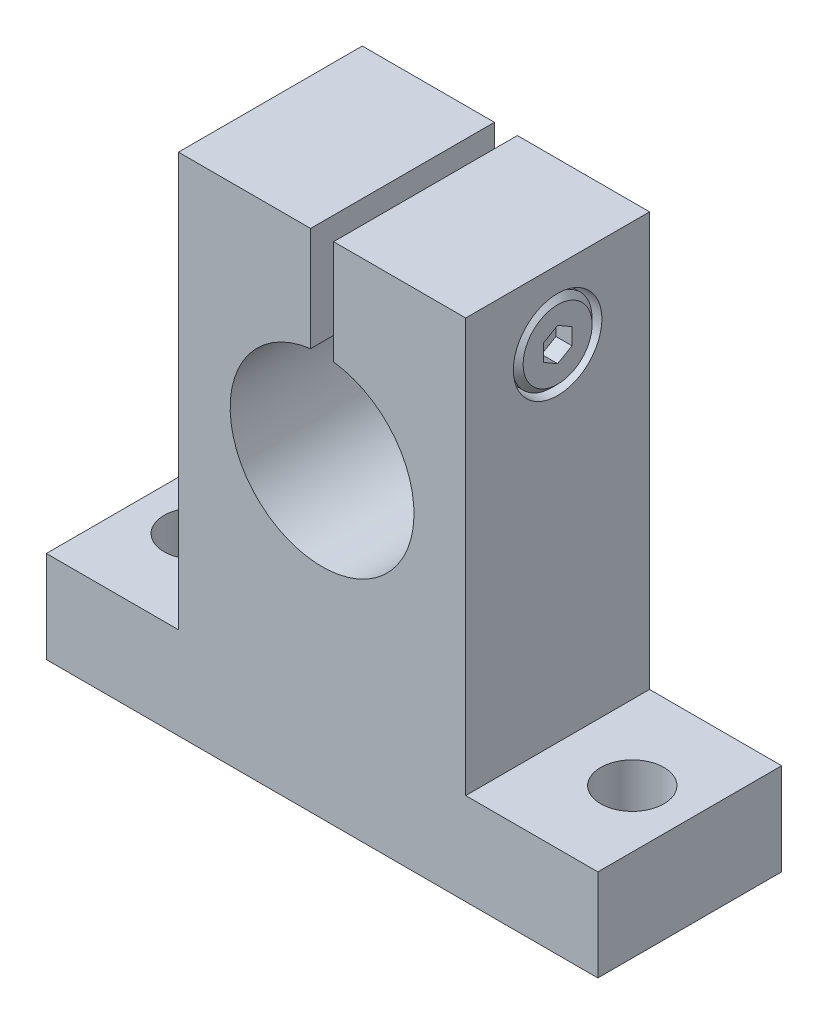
ISO-10303-21;
HEADER;
FILE_DESCRIPTION(('STEP AP214'),'2;1');
FILE_NAME('part.step','',(''),(''),'','','');
FILE_SCHEMA(('AUTOMOTIVE_DESIGN { 1 0 10303 214 1 1 1 1 }'));
ENDSEC;
DATA;
#1=APPLICATION_CONTEXT('core data for automotive mechanical design processes');
#2=APPLICATION_PROTOCOL_DEFINITION('international standard','automotive_design',2000,#1);
#3=PRODUCT_CONTEXT('',#1,'mechanical');
#4=PRODUCT('Part','Part','',(#3));
#5=PRODUCT_RELATED_PRODUCT_CATEGORY('part','',(#4));
#6=PRODUCT_DEFINITION_FORMATION('','',#4);
#7=PRODUCT_DEFINITION_CONTEXT('part definition',#1,'design');
#8=PRODUCT_DEFINITION('design','',#6,#7);
#9=PRODUCT_DEFINITION_SHAPE('','',#8);
#10=(LENGTH_UNIT() NAMED_UNIT(*) SI_UNIT(.MILLI.,.METRE.));
#11=(NAMED_UNIT(*) PLANE_ANGLE_UNIT() SI_UNIT($,.RADIAN.));
#12=(NAMED_UNIT(*) SI_UNIT($,.STERADIAN.) SOLID_ANGLE_UNIT());
#13=UNCERTAINTY_MEASURE_WITH_UNIT(LENGTH_MEASURE(1.E-05),#10,'distance_accuracy_value','');
#14=(GEOMETRIC_REPRESENTATION_CONTEXT(3) GLOBAL_UNCERTAINTY_ASSIGNED_CONTEXT((#13)) GLOBAL_UNIT_ASSIGNED_CONTEXT((#10,
#11,#12)) REPRESENTATION_CONTEXT('',''));
#15=CARTESIAN_POINT('',(0.,0.,0.));
#16=DIRECTION('',(0.,0.,1.));
#17=DIRECTION('',(1.,0.,0.));
#18=AXIS2_PLACEMENT_3D('',#15,#16,#17);
#19=CARTESIAN_POINT('',(0.,0.,-16.));
#20=DIRECTION('',(0.,0.,1.));
#21=DIRECTION('',(1.,0.,0.));
#22=AXIS2_PLACEMENT_3D('',#19,#20,#21);
#23=PLANE('',#22);
#24=DIRECTION('',(0.,1.,0.));
#25=VECTOR('',#24,1.);
#26=CARTESIAN_POINT('',(1.,0.,-16.));
#27=LINE('',#26,#25);
#28=CARTESIAN_POINT('',(1.,7.93725393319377,-16.));
#29=VERTEX_POINT('',#28);
#30=CARTESIAN_POINT('',(1.,17.,-16.));
#31=VERTEX_POINT('',#30);
#32=EDGE_CURVE('E222',#29,#31,#27,.T.);
#33=ORIENTED_EDGE('',*,*,#32,.T.);
#34=DIRECTION('',(-1.,0.,0.));
#35=VECTOR('',#34,1.);
#36=CARTESIAN_POINT('',(12.5,17.,-16.));
#37=LINE('',#36,#35);
#38=CARTESIAN_POINT('',(12.5,17.,-16.));
#39=VERTEX_POINT('',#38);
#40=EDGE_CURVE('E216',#39,#31,#37,.T.);
#41=ORIENTED_EDGE('',*,*,#40,.F.);
#42=DIRECTION('',(0.,1.,0.));
#43=VECTOR('',#42,1.);
#44=CARTESIAN_POINT('',(12.5,-19.,-16.));
#45=LINE('',#44,#43);
#46=CARTESIAN_POINT('',(12.5,-19.,-16.));
#47=VERTEX_POINT('',#46);
#48=EDGE_CURVE('E219',#47,#39,#45,.T.);
#49=ORIENTED_EDGE('',*,*,#48,.F.);
#50=DIRECTION('',(-1.,0.,0.));
#51=VECTOR('',#50,1.);
#52=CARTESIAN_POINT('',(24.,-19.,-16.));
#53=LINE('',#52,#51);
#54=CARTESIAN_POINT('',(24.,-19.,-16.));
#55=VERTEX_POINT('',#54);
#56=EDGE_CURVE('E247',#55,#47,#53,.T.);
#57=ORIENTED_EDGE('',*,*,#56,.F.);
#58=DIRECTION('',(0.,1.,0.));
#59=VECTOR('',#58,1.);
#60=CARTESIAN_POINT('',(24.,-27.,-16.));
#61=LINE('',#60,#59);
#62=CARTESIAN_POINT('',(24.,-27.,-16.));
#63=VERTEX_POINT('',#62);
#64=EDGE_CURVE('E388',#63,#55,#61,.T.);
#65=ORIENTED_EDGE('',*,*,#64,.F.);
#66=DIRECTION('',(1.,0.,0.));
#67=VECTOR('',#66,1.);
#68=CARTESIAN_POINT('',(-24.,-27.,-16.));
#69=LINE('',#68,#67);
#70=CARTESIAN_POINT('',(-24.,-27.,-16.));
#71=VERTEX_POINT('',#70);
#72=EDGE_CURVE('E10',#71,#63,#69,.T.);
#73=ORIENTED_EDGE('',*,*,#72,.F.);
#74=DIRECTION('',(0.,-1.,0.));
#75=VECTOR('',#74,1.);
#76=CARTESIAN_POINT('',(-24.,-19.,-16.));
#77=LINE('',#76,#75);
#78=CARTESIAN_POINT('',(-24.,-19.,-16.));
#79=VERTEX_POINT('',#78);
#80=EDGE_CURVE('E45',#79,#71,#77,.T.);
#81=ORIENTED_EDGE('',*,*,#80,.F.);
#82=DIRECTION('',(-1.,0.,0.));
#83=VECTOR('',#82,1.);
#84=CARTESIAN_POINT('',(-12.5,-19.,-16.));
#85=LINE('',#84,#83);
#86=CARTESIAN_POINT('',(-12.5,-19.,-16.));
#87=VERTEX_POINT('',#86);
#88=EDGE_CURVE('E254',#87,#79,#85,.T.);
#89=ORIENTED_EDGE('',*,*,#88,.F.);
#90=DIRECTION('',(0.,-1.,0.));
#91=VECTOR('',#90,1.);
#92=CARTESIAN_POINT('',(-12.5,17.,-16.));
#93=LINE('',#92,#91);
#94=CARTESIAN_POINT('',(-12.5,17.,-16.));
#95=VERTEX_POINT('',#94);
#96=EDGE_CURVE('E227',#95,#87,#93,.T.);
#97=ORIENTED_EDGE('',*,*,#96,.F.);
#98=DIRECTION('',(-1.,0.,0.));
#99=VECTOR('',#98,1.);
#100=CARTESIAN_POINT('',(12.5,17.,-16.));
#101=LINE('',#100,#99);
#102=CARTESIAN_POINT('',(-1.,17.,-16.));
#103=VERTEX_POINT('',#102);
#104=EDGE_CURVE('E276',#103,#95,#101,.T.);
#105=ORIENTED_EDGE('',*,*,#104,.F.);
#106=DIRECTION('',(0.,-1.,0.));
#107=VECTOR('',#106,1.);
#108=CARTESIAN_POINT('',(-1.,8.5,-16.));
#109=LINE('',#108,#107);
#110=CARTESIAN_POINT('',(-1.,7.93725393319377,-16.));
#111=VERTEX_POINT('',#110);
#112=EDGE_CURVE('E344',#103,#111,#109,.T.);
#113=ORIENTED_EDGE('',*,*,#112,.T.);
#114=CARTESIAN_POINT('',(0.,0.,-16.));
#115=DIRECTION('',(0.,0.,1.));
#116=DIRECTION('',(1.,0.,0.));
#117=AXIS2_PLACEMENT_3D('',#114,#115,#116);
#118=CIRCLE('',#117,8.);
#119=EDGE_CURVE('E429',#111,#29,#118,.T.);
#120=ORIENTED_EDGE('',*,*,#119,.T.);
#121=EDGE_LOOP('',(#33,#41,#49,#57,#65,#73,#81,#89,#97,#105,#113,#120));
#122=FACE_BOUND('',#121,.T.);
#123=ADVANCED_FACE('F16',(#122),#23,.F.);
#124=CARTESIAN_POINT('',(-24.,-27.,0.));
#125=DIRECTION('',(0.,-1.,0.));
#126=DIRECTION('',(0.,0.,-1.));
#127=AXIS2_PLACEMENT_3D('',#124,#125,#126);
#128=PLANE('',#127);
#129=CARTESIAN_POINT('',(19.,-27.,-8.));
#130=DIRECTION('',(0.,1.,0.));
#131=DIRECTION('',(0.,0.,-1.));
#132=AXIS2_PLACEMENT_3D('',#129,#130,#131);
#133=CIRCLE('',#132,2.75);
#134=CARTESIAN_POINT('',(19.,-27.,-5.25));
#135=VERTEX_POINT('',#134);
#136=EDGE_CURVE('E461',#135,#135,#133,.T.);
#137=ORIENTED_EDGE('',*,*,#136,.T.);
#138=EDGE_LOOP('',(#137));
#139=FACE_BOUND('',#138,.T.);
#140=CARTESIAN_POINT('',(-19.,-27.,-8.));
#141=DIRECTION('',(0.,1.,0.));
#142=DIRECTION('',(0.,0.,-1.));
#143=AXIS2_PLACEMENT_3D('',#140,#141,#142);
#144=CIRCLE('',#143,2.75);
#145=CARTESIAN_POINT('',(-19.,-27.,-5.25));
#146=VERTEX_POINT('',#145);
#147=EDGE_CURVE('E452',#146,#146,#144,.T.);
#148=ORIENTED_EDGE('',*,*,#147,.T.);
#149=EDGE_LOOP('',(#148));
#150=FACE_BOUND('',#149,.T.);
#151=ORIENTED_EDGE('',*,*,#72,.T.);
#152=DIRECTION('',(0.,0.,-1.));
#153=VECTOR('',#152,1.);
#154=CARTESIAN_POINT('',(24.,-27.,0.));
#155=LINE('',#154,#153);
#156=CARTESIAN_POINT('',(24.,-27.,0.));
#157=VERTEX_POINT('',#156);
#158=EDGE_CURVE('E336',#157,#63,#155,.T.);
#159=ORIENTED_EDGE('',*,*,#158,.F.);
#160=DIRECTION('',(1.,0.,0.));
#161=VECTOR('',#160,1.);
#162=CARTESIAN_POINT('',(-24.,-27.,0.));
#163=LINE('',#162,#161);
#164=CARTESIAN_POINT('',(-24.,-27.,0.));
#165=VERTEX_POINT('',#164);
#166=EDGE_CURVE('E367',#165,#157,#163,.T.);
#167=ORIENTED_EDGE('',*,*,#166,.F.);
#168=DIRECTION('',(0.,0.,-1.));
#169=VECTOR('',#168,1.);
#170=CARTESIAN_POINT('',(-24.,-27.,0.));
#171=LINE('',#170,#169);
#172=EDGE_CURVE('E25',#165,#71,#171,.T.);
#173=ORIENTED_EDGE('',*,*,#172,.T.);
#174=EDGE_LOOP('',(#151,#159,#167,#173));
#175=FACE_BOUND('',#174,.T.);
#176=ADVANCED_FACE('F412',(#139,#150,#175),#128,.T.);
#177=CARTESIAN_POINT('',(-24.,-19.,0.));
#178=DIRECTION('',(-1.,0.,0.));
#179=DIRECTION('',(0.,0.,1.));
#180=AXIS2_PLACEMENT_3D('',#177,#178,#179);
#181=PLANE('',#180);
#182=ORIENTED_EDGE('',*,*,#80,.T.);
#183=ORIENTED_EDGE('',*,*,#172,.F.);
#184=DIRECTION('',(0.,-1.,0.));
#185=VECTOR('',#184,1.);
#186=CARTESIAN_POINT('',(-24.,-19.,0.));
#187=LINE('',#186,#185);
#188=CARTESIAN_POINT('',(-24.,-19.,0.));
#189=VERTEX_POINT('',#188);
#190=EDGE_CURVE('E363',#189,#165,#187,.T.);
#191=ORIENTED_EDGE('',*,*,#190,.F.);
#192=DIRECTION('',(0.,0.,-1.));
#193=VECTOR('',#192,1.);
#194=CARTESIAN_POINT('',(-24.,-19.,0.));
#195=LINE('',#194,#193);
#196=EDGE_CURVE('E256',#189,#79,#195,.T.);
#197=ORIENTED_EDGE('',*,*,#196,.T.);
#198=EDGE_LOOP('',(#182,#183,#191,#197));
#199=FACE_BOUND('',#198,.T.);
#200=ADVANCED_FACE('F18',(#199),#181,.T.);
#201=CARTESIAN_POINT('',(-12.5,-19.,0.));
#202=DIRECTION('',(0.,1.,0.));
#203=DIRECTION('',(1.,0.,0.));
#204=AXIS2_PLACEMENT_3D('',#201,#202,#203);
#205=PLANE('',#204);
#206=CARTESIAN_POINT('',(-19.,-19.,-8.));
#207=DIRECTION('',(0.,-1.,0.));
#208=DIRECTION('',(0.,0.,-1.));
#209=AXIS2_PLACEMENT_3D('',#206,#207,#208);
#210=CIRCLE('',#209,2.75);
#211=CARTESIAN_POINT('',(-19.,-19.,-5.25));
#212=VERTEX_POINT('',#211);
#213=EDGE_CURVE('E465',#212,#212,#210,.T.);
#214=ORIENTED_EDGE('',*,*,#213,.T.);
#215=EDGE_LOOP('',(#214));
#216=FACE_BOUND('',#215,.T.);
#217=ORIENTED_EDGE('',*,*,#88,.T.);
#218=ORIENTED_EDGE('',*,*,#196,.F.);
#219=DIRECTION('',(-1.,0.,0.));
#220=VECTOR('',#219,1.);
#221=CARTESIAN_POINT('',(-12.5,-19.,0.));
#222=LINE('',#221,#220);
#223=CARTESIAN_POINT('',(-12.5,-19.,0.));
#224=VERTEX_POINT('',#223);
#225=EDGE_CURVE('E359',#224,#189,#222,.T.);
#226=ORIENTED_EDGE('',*,*,#225,.F.);
#227=DIRECTION('',(0.,0.,-1.));
#228=VECTOR('',#227,1.);
#229=CARTESIAN_POINT('',(-12.5,-19.,0.));
#230=LINE('',#229,#228);
#231=EDGE_CURVE('E251',#224,#87,#230,.T.);
#232=ORIENTED_EDGE('',*,*,#231,.T.);
#233=EDGE_LOOP('',(#217,#218,#226,#232));
#234=FACE_BOUND('',#233,.T.);
#235=ADVANCED_FACE('F416',(#216,#234),#205,.T.);
#236=CARTESIAN_POINT('',(-12.5,17.,0.));
#237=DIRECTION('',(-1.,0.,0.));
#238=DIRECTION('',(0.,0.,1.));
#239=AXIS2_PLACEMENT_3D('',#236,#237,#238);
#240=PLANE('',#239);
#241=ORIENTED_EDGE('',*,*,#96,.T.);
#242=ORIENTED_EDGE('',*,*,#231,.F.);
#243=DIRECTION('',(0.,-1.,0.));
#244=VECTOR('',#243,1.);
#245=CARTESIAN_POINT('',(-12.5,17.,0.));
#246=LINE('',#245,#244);
#247=CARTESIAN_POINT('',(-12.5,17.,0.));
#248=VERTEX_POINT('',#247);
#249=EDGE_CURVE('E355',#248,#224,#246,.T.);
#250=ORIENTED_EDGE('',*,*,#249,.F.);
#251=DIRECTION('',(0.,0.,-1.));
#252=VECTOR('',#251,1.);
#253=CARTESIAN_POINT('',(-12.5,17.,0.));
#254=LINE('',#253,#252);
#255=EDGE_CURVE('E384',#248,#95,#254,.T.);
#256=ORIENTED_EDGE('',*,*,#255,.T.);
#257=EDGE_LOOP('',(#241,#242,#250,#256));
#258=FACE_BOUND('',#257,.T.);
#259=ADVANCED_FACE('F418',(#258),#240,.T.);
#260=CARTESIAN_POINT('',(12.5,17.,0.));
#261=DIRECTION('',(0.,1.,0.));
#262=DIRECTION('',(1.,0.,0.));
#263=AXIS2_PLACEMENT_3D('',#260,#261,#262);
#264=PLANE('',#263);
#265=DIRECTION('',(0.,0.,1.));
#266=VECTOR('',#265,1.);
#267=CARTESIAN_POINT('',(1.,17.,0.));
#268=LINE('',#267,#266);
#269=CARTESIAN_POINT('',(1.,17.,0.));
#270=VERTEX_POINT('',#269);
#271=EDGE_CURVE('E320',#31,#270,#268,.T.);
#272=ORIENTED_EDGE('',*,*,#271,.T.);
#273=DIRECTION('',(-1.,0.,0.));
#274=VECTOR('',#273,1.);
#275=CARTESIAN_POINT('',(12.5,17.,0.));
#276=LINE('',#275,#274);
#277=CARTESIAN_POINT('',(12.5,17.,0.));
#278=VERTEX_POINT('',#277);
#279=EDGE_CURVE('E232',#278,#270,#276,.T.);
#280=ORIENTED_EDGE('',*,*,#279,.F.);
#281=DIRECTION('',(0.,0.,-1.));
#282=VECTOR('',#281,1.);
#283=CARTESIAN_POINT('',(12.5,17.,0.));
#284=LINE('',#283,#282);
#285=EDGE_CURVE('E228',#278,#39,#284,.T.);
#286=ORIENTED_EDGE('',*,*,#285,.T.);
#287=ORIENTED_EDGE('',*,*,#40,.T.);
#288=EDGE_LOOP('',(#272,#280,#286,#287));
#289=FACE_BOUND('',#288,.T.);
#290=ADVANCED_FACE('F231',(#289),#264,.T.);
#291=CARTESIAN_POINT('',(12.5,-19.,0.));
#292=DIRECTION('',(1.,0.,0.));
#293=DIRECTION('',(0.,1.,0.));
#294=AXIS2_PLACEMENT_3D('',#291,#292,#293);
#295=PLANE('',#294);
#296=CARTESIAN_POINT('',(12.5,11.,-8.));
#297=DIRECTION('',(-1.,0.,0.));
#298=DIRECTION('',(0.,0.,-1.));
#299=AXIS2_PLACEMENT_3D('',#296,#297,#298);
#300=CIRCLE('',#299,3.85);
#301=CARTESIAN_POINT('',(12.5,11.,-4.15));
#302=VERTEX_POINT('',#301);
#303=EDGE_CURVE('E480',#302,#302,#300,.T.);
#304=ORIENTED_EDGE('',*,*,#303,.T.);
#305=EDGE_LOOP('',(#304));
#306=FACE_BOUND('',#305,.T.);
#307=ORIENTED_EDGE('',*,*,#48,.T.);
#308=ORIENTED_EDGE('',*,*,#285,.F.);
#309=DIRECTION('',(0.,1.,0.));
#310=VECTOR('',#309,1.);
#311=CARTESIAN_POINT('',(12.5,-19.,0.));
#312=LINE('',#311,#310);
#313=CARTESIAN_POINT('',(12.5,-19.,0.));
#314=VERTEX_POINT('',#313);
#315=EDGE_CURVE('E277',#314,#278,#312,.T.);
#316=ORIENTED_EDGE('',*,*,#315,.F.);
#317=DIRECTION('',(0.,0.,-1.));
#318=VECTOR('',#317,1.);
#319=CARTESIAN_POINT('',(12.5,-19.,0.));
#320=LINE('',#319,#318);
#321=EDGE_CURVE('E239',#314,#47,#320,.T.);
#322=ORIENTED_EDGE('',*,*,#321,.T.);
#323=EDGE_LOOP('',(#307,#308,#316,#322));
#324=FACE_BOUND('',#323,.T.);
#325=ADVANCED_FACE('F238',(#306,#324),#295,.T.);
#326=CARTESIAN_POINT('',(24.,-19.,0.));
#327=DIRECTION('',(0.,1.,0.));
#328=DIRECTION('',(1.,0.,0.));
#329=AXIS2_PLACEMENT_3D('',#326,#327,#328);
#330=PLANE('',#329);
#331=CARTESIAN_POINT('',(19.,-19.,-8.));
#332=DIRECTION('',(0.,-1.,0.));
#333=DIRECTION('',(0.,0.,-1.));
#334=AXIS2_PLACEMENT_3D('',#331,#332,#333);
#335=CIRCLE('',#334,2.75);
#336=CARTESIAN_POINT('',(19.,-19.,-5.25));
#337=VERTEX_POINT('',#336);
#338=EDGE_CURVE('E575',#337,#337,#335,.T.);
#339=ORIENTED_EDGE('',*,*,#338,.T.);
#340=EDGE_LOOP('',(#339));
#341=FACE_BOUND('',#340,.T.);
#342=ORIENTED_EDGE('',*,*,#56,.T.);
#343=ORIENTED_EDGE('',*,*,#321,.F.);
#344=DIRECTION('',(-1.,0.,0.));
#345=VECTOR('',#344,1.);
#346=CARTESIAN_POINT('',(24.,-19.,0.));
#347=LINE('',#346,#345);
#348=CARTESIAN_POINT('',(24.,-19.,0.));
#349=VERTEX_POINT('',#348);
#350=EDGE_CURVE('E375',#349,#314,#347,.T.);
#351=ORIENTED_EDGE('',*,*,#350,.F.);
#352=DIRECTION('',(0.,0.,-1.));
#353=VECTOR('',#352,1.);
#354=CARTESIAN_POINT('',(24.,-19.,0.));
#355=LINE('',#354,#353);
#356=EDGE_CURVE('E395',#349,#55,#355,.T.);
#357=ORIENTED_EDGE('',*,*,#356,.T.);
#358=EDGE_LOOP('',(#342,#343,#351,#357));
#359=FACE_BOUND('',#358,.T.);
#360=ADVANCED_FACE('F409',(#341,#359),#330,.T.);
#361=CARTESIAN_POINT('',(24.,-27.,0.));
#362=DIRECTION('',(1.,0.,0.));
#363=DIRECTION('',(0.,1.,0.));
#364=AXIS2_PLACEMENT_3D('',#361,#362,#363);
#365=PLANE('',#364);
#366=ORIENTED_EDGE('',*,*,#64,.T.);
#367=ORIENTED_EDGE('',*,*,#356,.F.);
#368=DIRECTION('',(0.,1.,0.));
#369=VECTOR('',#368,1.);
#370=CARTESIAN_POINT('',(24.,-27.,0.));
#371=LINE('',#370,#369);
#372=EDGE_CURVE('E371',#157,#349,#371,.T.);
#373=ORIENTED_EDGE('',*,*,#372,.F.);
#374=ORIENTED_EDGE('',*,*,#158,.T.);
#375=EDGE_LOOP('',(#366,#367,#373,#374));
#376=FACE_BOUND('',#375,.T.);
#377=ADVANCED_FACE('F404',(#376),#365,.T.);
#378=CARTESIAN_POINT('',(12.5,17.,0.));
#379=DIRECTION('',(0.,1.,0.));
#380=DIRECTION('',(1.,0.,0.));
#381=AXIS2_PLACEMENT_3D('',#378,#379,#380);
#382=PLANE('',#381);
#383=DIRECTION('',(0.,0.,-1.));
#384=VECTOR('',#383,1.);
#385=CARTESIAN_POINT('',(-1.,17.,0.));
#386=LINE('',#385,#384);
#387=CARTESIAN_POINT('',(-1.,17.,0.));
#388=VERTEX_POINT('',#387);
#389=EDGE_CURVE('E339',#388,#103,#386,.T.);
#390=ORIENTED_EDGE('',*,*,#389,.T.);
#391=ORIENTED_EDGE('',*,*,#104,.T.);
#392=ORIENTED_EDGE('',*,*,#255,.F.);
#393=DIRECTION('',(-1.,0.,0.));
#394=VECTOR('',#393,1.);
#395=CARTESIAN_POINT('',(12.5,17.,0.));
#396=LINE('',#395,#394);
#397=EDGE_CURVE('E351',#388,#248,#396,.T.);
#398=ORIENTED_EDGE('',*,*,#397,.F.);
#399=EDGE_LOOP('',(#390,#391,#392,#398));
#400=FACE_BOUND('',#399,.T.);
#401=ADVANCED_FACE('F420',(#400),#382,.T.);
#402=CARTESIAN_POINT('',(0.,0.,0.));
#403=DIRECTION('',(0.,0.,1.));
#404=DIRECTION('',(1.,0.,0.));
#405=AXIS2_PLACEMENT_3D('',#402,#403,#404);
#406=PLANE('',#405);
#407=DIRECTION('',(0.,-1.,0.));
#408=VECTOR('',#407,1.);
#409=CARTESIAN_POINT('',(1.,0.,0.));
#410=LINE('',#409,#408);
#411=CARTESIAN_POINT('',(1.,7.93725393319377,0.));
#412=VERTEX_POINT('',#411);
#413=EDGE_CURVE('E317',#270,#412,#410,.T.);
#414=ORIENTED_EDGE('',*,*,#413,.T.);
#415=CARTESIAN_POINT('',(0.,0.,0.));
#416=DIRECTION('',(0.,0.,-1.));
#417=DIRECTION('',(1.,0.,0.));
#418=AXIS2_PLACEMENT_3D('',#415,#416,#417);
#419=CIRCLE('',#418,8.);
#420=CARTESIAN_POINT('',(-1.,7.93725393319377,0.));
#421=VERTEX_POINT('',#420);
#422=EDGE_CURVE('E567',#412,#421,#419,.T.);
#423=ORIENTED_EDGE('',*,*,#422,.T.);
#424=DIRECTION('',(0.,1.,0.));
#425=VECTOR('',#424,1.);
#426=CARTESIAN_POINT('',(-1.,8.5,0.));
#427=LINE('',#426,#425);
#428=EDGE_CURVE('E343',#421,#388,#427,.T.);
#429=ORIENTED_EDGE('',*,*,#428,.T.);
#430=ORIENTED_EDGE('',*,*,#397,.T.);
#431=ORIENTED_EDGE('',*,*,#249,.T.);
#432=ORIENTED_EDGE('',*,*,#225,.T.);
#433=ORIENTED_EDGE('',*,*,#190,.T.);
#434=ORIENTED_EDGE('',*,*,#166,.T.);
#435=ORIENTED_EDGE('',*,*,#372,.T.);
#436=ORIENTED_EDGE('',*,*,#350,.T.);
#437=ORIENTED_EDGE('',*,*,#315,.T.);
#438=ORIENTED_EDGE('',*,*,#279,.T.);
#439=EDGE_LOOP('',(#414,#423,#429,#430,#431,#432,#433,#434,#435,#436,#437,#438));
#440=FACE_BOUND('',#439,.T.);
#441=ADVANCED_FACE('F411',(#440),#406,.T.);
#442=CARTESIAN_POINT('',(-1.,17.,0.));
#443=DIRECTION('',(-1.,0.,0.));
#444=DIRECTION('',(0.,0.,1.));
#445=AXIS2_PLACEMENT_3D('',#442,#443,#444);
#446=PLANE('',#445);
#447=CARTESIAN_POINT('',(-1.,11.,-8.));
#448=DIRECTION('',(-1.,0.,0.));
#449=DIRECTION('',(0.,1.,0.));
#450=AXIS2_PLACEMENT_3D('',#447,#448,#449);
#451=CIRCLE('',#450,2.);
#452=CARTESIAN_POINT('',(-1.,9.,-8.));
#453=VERTEX_POINT('',#452);
#454=EDGE_CURVE('E445',#453,#453,#451,.T.);
#455=ORIENTED_EDGE('',*,*,#454,.T.);
#456=EDGE_LOOP('',(#455));
#457=FACE_BOUND('',#456,.T.);
#458=DIRECTION('',(0.,0.,1.));
#459=VECTOR('',#458,1.);
#460=CARTESIAN_POINT('',(-1.,7.93725393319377,-8.));
#461=LINE('',#460,#459);
#462=EDGE_CURVE('E427',#111,#421,#461,.T.);
#463=ORIENTED_EDGE('',*,*,#462,.F.);
#464=ORIENTED_EDGE('',*,*,#112,.F.);
#465=ORIENTED_EDGE('',*,*,#389,.F.);
#466=ORIENTED_EDGE('',*,*,#428,.F.);
#467=EDGE_LOOP('',(#463,#464,#465,#466));
#468=FACE_BOUND('',#467,.T.);
#469=ADVANCED_FACE('F425',(#457,#468),#446,.F.);
#470=CARTESIAN_POINT('',(1.,0.,0.));
#471=DIRECTION('',(1.,0.,0.));
#472=DIRECTION('',(0.,1.,0.));
#473=AXIS2_PLACEMENT_3D('',#470,#471,#472);
#474=PLANE('',#473);
#475=CARTESIAN_POINT('',(1.,11.,-8.));
#476=DIRECTION('',(1.,0.,0.));
#477=DIRECTION('',(0.,1.,0.));
#478=AXIS2_PLACEMENT_3D('',#475,#476,#477);
#479=CIRCLE('',#478,2.);
#480=CARTESIAN_POINT('',(1.,9.,-8.));
#481=VERTEX_POINT('',#480);
#482=EDGE_CURVE('E444',#481,#481,#479,.T.);
#483=ORIENTED_EDGE('',*,*,#482,.T.);
#484=EDGE_LOOP('',(#483));
#485=FACE_BOUND('',#484,.T.);
#486=DIRECTION('',(0.,0.,-1.));
#487=VECTOR('',#486,1.);
#488=CARTESIAN_POINT('',(1.,7.93725393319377,-8.));
#489=LINE('',#488,#487);
#490=EDGE_CURVE('E570',#412,#29,#489,.T.);
#491=ORIENTED_EDGE('',*,*,#490,.F.);
#492=ORIENTED_EDGE('',*,*,#413,.F.);
#493=ORIENTED_EDGE('',*,*,#271,.F.);
#494=ORIENTED_EDGE('',*,*,#32,.F.);
#495=EDGE_LOOP('',(#491,#492,#493,#494));
#496=FACE_BOUND('',#495,.T.);
#497=ADVANCED_FACE('F449',(#485,#496),#474,.F.);
#498=CARTESIAN_POINT('',(9.7,0.,0.));
#499=DIRECTION('',(1.,0.,0.));
#500=DIRECTION('',(0.,1.,0.));
#501=AXIS2_PLACEMENT_3D('',#498,#499,#500);
#502=PLANE('',#501);
#503=CARTESIAN_POINT('',(9.7,11.,-8.));
#504=DIRECTION('',(-1.,0.,0.));
#505=DIRECTION('',(0.,1.,0.));
#506=AXIS2_PLACEMENT_3D('',#503,#504,#505);
#507=CIRCLE('',#506,3.5);
#508=CARTESIAN_POINT('',(9.7,7.5,-8.));
#509=VERTEX_POINT('',#508);
#510=EDGE_CURVE('E495',#509,#509,#507,.T.);
#511=ORIENTED_EDGE('',*,*,#510,.T.);
#512=EDGE_LOOP('',(#511));
#513=FACE_BOUND('',#512,.T.);
#514=CARTESIAN_POINT('',(9.7,11.,-8.));
#515=DIRECTION('',(1.,0.,0.));
#516=DIRECTION('',(0.,0.,-1.));
#517=AXIS2_PLACEMENT_3D('',#514,#515,#516);
#518=CIRCLE('',#517,3.85);
#519=CARTESIAN_POINT('',(9.7,11.,-4.15));
#520=VERTEX_POINT('',#519);
#521=EDGE_CURVE('E467',#520,#520,#518,.T.);
#522=ORIENTED_EDGE('',*,*,#521,.T.);
#523=EDGE_LOOP('',(#522));
#524=FACE_BOUND('',#523,.T.);
#525=ADVANCED_FACE('F515',(#513,#524),#502,.T.);
#526=CARTESIAN_POINT('',(12.5,12.5,-8.));
#527=DIRECTION('',(1.,0.,0.));
#528=DIRECTION('',(0.,1.,0.));
#529=AXIS2_PLACEMENT_3D('',#526,#527,#528);
#530=PLANE('',#529);
#531=DIRECTION('',(0.,0.5,0.866025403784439));
#532=VECTOR('',#531,1.);
#533=CARTESIAN_POINT('',(12.5,10.2853902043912,-6.73774047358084));
#534=LINE('',#533,#532);
#535=CARTESIAN_POINT('',(12.5,9.55662432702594,-8.));
#536=VERTEX_POINT('',#535);
#537=CARTESIAN_POINT('',(12.5,10.278312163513,-6.75));
#538=VERTEX_POINT('',#537);
#539=EDGE_CURVE('E278',#536,#538,#534,.T.);
#540=ORIENTED_EDGE('',*,*,#539,.T.);
#541=DIRECTION('',(0.,1.,0.));
#542=VECTOR('',#541,1.);
#543=CARTESIAN_POINT('',(12.5,12.1108439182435,-6.75));
#544=LINE('',#543,#542);
#545=CARTESIAN_POINT('',(12.5,11.721687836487,-6.75));
#546=VERTEX_POINT('',#545);
#547=EDGE_CURVE('E321',#538,#546,#544,.T.);
#548=ORIENTED_EDGE('',*,*,#547,.T.);
#549=DIRECTION('',(0.,0.5,-0.866025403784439));
#550=VECTOR('',#549,1.);
#551=CARTESIAN_POINT('',(12.5,12.4504537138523,-8.01225952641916));
#552=LINE('',#551,#550);
#553=CARTESIAN_POINT('',(12.5,12.4433756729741,-8.));
#554=VERTEX_POINT('',#553);
#555=EDGE_CURVE('E325',#546,#554,#552,.T.);
#556=ORIENTED_EDGE('',*,*,#555,.T.);
#557=DIRECTION('',(0.,-0.5,-0.866025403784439));
#558=VECTOR('',#557,1.);
#559=CARTESIAN_POINT('',(12.5,12.0896097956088,-8.61274047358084));
#560=LINE('',#559,#558);
#561=CARTESIAN_POINT('',(12.5,11.721687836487,-9.25));
#562=VERTEX_POINT('',#561);
#563=EDGE_CURVE('E309',#554,#562,#560,.T.);
#564=ORIENTED_EDGE('',*,*,#563,.T.);
#565=DIRECTION('',(0.,-1.,0.));
#566=VECTOR('',#565,1.);
#567=CARTESIAN_POINT('',(12.5,11.3891560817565,-9.25));
#568=LINE('',#567,#566);
#569=CARTESIAN_POINT('',(12.5,10.278312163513,-9.25));
#570=VERTEX_POINT('',#569);
#571=EDGE_CURVE('E292',#562,#570,#568,.T.);
#572=ORIENTED_EDGE('',*,*,#571,.T.);
#573=DIRECTION('',(0.,-0.5,0.866025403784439));
#574=VECTOR('',#573,1.);
#575=CARTESIAN_POINT('',(12.5,9.92454628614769,-8.63725952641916));
#576=LINE('',#575,#574);
#577=EDGE_CURVE('E296',#570,#536,#576,.T.);
#578=ORIENTED_EDGE('',*,*,#577,.T.);
#579=EDGE_LOOP('',(#540,#548,#556,#564,#572,#578));
#580=FACE_BOUND('',#579,.T.);
#581=CARTESIAN_POINT('',(12.5,11.,-8.));
#582=DIRECTION('',(-1.,0.,0.));
#583=DIRECTION('',(0.,1.,0.));
#584=AXIS2_PLACEMENT_3D('',#581,#582,#583);
#585=CIRCLE('',#584,3.);
#586=CARTESIAN_POINT('',(12.5,8.,-8.));
#587=VERTEX_POINT('',#586);
#588=EDGE_CURVE('E485',#587,#587,#585,.T.);
#589=ORIENTED_EDGE('',*,*,#588,.F.);
#590=EDGE_LOOP('',(#589));
#591=FACE_BOUND('',#590,.T.);
#592=ADVANCED_FACE('F512',(#580,#591),#530,.T.);
#593=CARTESIAN_POINT('',(11.1,0.,0.));
#594=DIRECTION('',(1.,0.,0.));
#595=DIRECTION('',(0.,1.,0.));
#596=AXIS2_PLACEMENT_3D('',#593,#594,#595);
#597=PLANE('',#596);
#598=DIRECTION('',(0.,-0.5,-0.866025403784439));
#599=VECTOR('',#598,1.);
#600=CARTESIAN_POINT('',(11.1,10.278312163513,-6.75));
#601=LINE('',#600,#599);
#602=CARTESIAN_POINT('',(11.1,10.278312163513,-6.75));
#603=VERTEX_POINT('',#602);
#604=CARTESIAN_POINT('',(11.1,9.55662432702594,-8.));
#605=VERTEX_POINT('',#604);
#606=EDGE_CURVE('E481',#603,#605,#601,.T.);
#607=ORIENTED_EDGE('',*,*,#606,.T.);
#608=DIRECTION('',(0.,0.5,-0.866025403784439));
#609=VECTOR('',#608,1.);
#610=CARTESIAN_POINT('',(11.1,9.55662432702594,-8.));
#611=LINE('',#610,#609);
#612=CARTESIAN_POINT('',(11.1,10.278312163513,-9.25));
#613=VERTEX_POINT('',#612);
#614=EDGE_CURVE('E286',#605,#613,#611,.T.);
#615=ORIENTED_EDGE('',*,*,#614,.T.);
#616=DIRECTION('',(0.,1.,0.));
#617=VECTOR('',#616,1.);
#618=CARTESIAN_POINT('',(11.1,10.278312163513,-9.25));
#619=LINE('',#618,#617);
#620=CARTESIAN_POINT('',(11.1,11.721687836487,-9.25));
#621=VERTEX_POINT('',#620);
#622=EDGE_CURVE('E300',#613,#621,#619,.T.);
#623=ORIENTED_EDGE('',*,*,#622,.T.);
#624=DIRECTION('',(0.,0.5,0.866025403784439));
#625=VECTOR('',#624,1.);
#626=CARTESIAN_POINT('',(11.1,11.721687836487,-9.25));
#627=LINE('',#626,#625);
#628=CARTESIAN_POINT('',(11.1,12.4433756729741,-8.));
#629=VERTEX_POINT('',#628);
#630=EDGE_CURVE('E291',#621,#629,#627,.T.);
#631=ORIENTED_EDGE('',*,*,#630,.T.);
#632=DIRECTION('',(0.,-0.5,0.866025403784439));
#633=VECTOR('',#632,1.);
#634=CARTESIAN_POINT('',(11.1,12.4433756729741,-8.));
#635=LINE('',#634,#633);
#636=CARTESIAN_POINT('',(11.1,11.721687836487,-6.75));
#637=VERTEX_POINT('',#636);
#638=EDGE_CURVE('E316',#629,#637,#635,.T.);
#639=ORIENTED_EDGE('',*,*,#638,.T.);
#640=DIRECTION('',(0.,-1.,0.));
#641=VECTOR('',#640,1.);
#642=CARTESIAN_POINT('',(11.1,11.721687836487,-6.75));
#643=LINE('',#642,#641);
#644=EDGE_CURVE('E329',#637,#603,#643,.T.);
#645=ORIENTED_EDGE('',*,*,#644,.T.);
#646=EDGE_LOOP('',(#607,#615,#623,#631,#639,#645));
#647=FACE_BOUND('',#646,.T.);
#648=ADVANCED_FACE('F514',(#647),#597,.T.);
#649=CARTESIAN_POINT('',(12.5,11.721687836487,-6.75));
#650=DIRECTION('',(0.,0.,1.));
#651=DIRECTION('',(1.,0.,0.));
#652=AXIS2_PLACEMENT_3D('',#649,#650,#651);
#653=PLANE('',#652);
#654=ORIENTED_EDGE('',*,*,#644,.F.);
#655=DIRECTION('',(-1.,0.,0.));
#656=VECTOR('',#655,1.);
#657=CARTESIAN_POINT('',(12.5,11.721687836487,-6.75));
#658=LINE('',#657,#656);
#659=EDGE_CURVE('E328',#546,#637,#658,.T.);
#660=ORIENTED_EDGE('',*,*,#659,.F.);
#661=ORIENTED_EDGE('',*,*,#547,.F.);
#662=DIRECTION('',(-1.,0.,0.));
#663=VECTOR('',#662,1.);
#664=CARTESIAN_POINT('',(12.5,10.278312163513,-6.75));
#665=LINE('',#664,#663);
#666=EDGE_CURVE('E272',#538,#603,#665,.T.);
#667=ORIENTED_EDGE('',*,*,#666,.T.);
#668=EDGE_LOOP('',(#654,#660,#661,#667));
#669=FACE_BOUND('',#668,.T.);
#670=ADVANCED_FACE('F523',(#669),#653,.F.);
#671=CARTESIAN_POINT('',(12.5,12.4433756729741,-8.));
#672=DIRECTION('',(0.,0.866025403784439,0.5));
#673=DIRECTION('',(1.,0.,0.));
#674=AXIS2_PLACEMENT_3D('',#671,#672,#673);
#675=PLANE('',#674);
#676=ORIENTED_EDGE('',*,*,#638,.F.);
#677=DIRECTION('',(-1.,0.,0.));
#678=VECTOR('',#677,1.);
#679=CARTESIAN_POINT('',(12.5,12.4433756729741,-8.));
#680=LINE('',#679,#678);
#681=EDGE_CURVE('E312',#554,#629,#680,.T.);
#682=ORIENTED_EDGE('',*,*,#681,.F.);
#683=ORIENTED_EDGE('',*,*,#555,.F.);
#684=ORIENTED_EDGE('',*,*,#659,.T.);
#685=EDGE_LOOP('',(#676,#682,#683,#684));
#686=FACE_BOUND('',#685,.T.);
#687=ADVANCED_FACE('F628',(#686),#675,.F.);
#688=CARTESIAN_POINT('',(12.5,11.721687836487,-9.25));
#689=DIRECTION('',(0.,0.866025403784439,-0.5));
#690=DIRECTION('',(-1.,0.,0.));
#691=AXIS2_PLACEMENT_3D('',#688,#689,#690);
#692=PLANE('',#691);
#693=ORIENTED_EDGE('',*,*,#630,.F.);
#694=DIRECTION('',(-1.,0.,0.));
#695=VECTOR('',#694,1.);
#696=CARTESIAN_POINT('',(12.5,11.721687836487,-9.25));
#697=LINE('',#696,#695);
#698=EDGE_CURVE('E287',#562,#621,#697,.T.);
#699=ORIENTED_EDGE('',*,*,#698,.F.);
#700=ORIENTED_EDGE('',*,*,#563,.F.);
#701=ORIENTED_EDGE('',*,*,#681,.T.);
#702=EDGE_LOOP('',(#693,#699,#700,#701));
#703=FACE_BOUND('',#702,.T.);
#704=ADVANCED_FACE('F619',(#703),#692,.F.);
#705=CARTESIAN_POINT('',(12.5,10.278312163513,-9.25));
#706=DIRECTION('',(0.,0.,-1.));
#707=DIRECTION('',(0.,-1.,0.));
#708=AXIS2_PLACEMENT_3D('',#705,#706,#707);
#709=PLANE('',#708);
#710=ORIENTED_EDGE('',*,*,#622,.F.);
#711=DIRECTION('',(-1.,0.,0.));
#712=VECTOR('',#711,1.);
#713=CARTESIAN_POINT('',(12.5,10.278312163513,-9.25));
#714=LINE('',#713,#712);
#715=EDGE_CURVE('E298',#570,#613,#714,.T.);
#716=ORIENTED_EDGE('',*,*,#715,.F.);
#717=ORIENTED_EDGE('',*,*,#571,.F.);
#718=ORIENTED_EDGE('',*,*,#698,.T.);
#719=EDGE_LOOP('',(#710,#716,#717,#718));
#720=FACE_BOUND('',#719,.T.);
#721=ADVANCED_FACE('F615',(#720),#709,.F.);
#722=CARTESIAN_POINT('',(12.5,9.55662432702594,-8.));
#723=DIRECTION('',(0.,-0.866025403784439,-0.5));
#724=DIRECTION('',(0.,0.5,-0.866025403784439));
#725=AXIS2_PLACEMENT_3D('',#722,#723,#724);
#726=PLANE('',#725);
#727=ORIENTED_EDGE('',*,*,#614,.F.);
#728=DIRECTION('',(-1.,0.,0.));
#729=VECTOR('',#728,1.);
#730=CARTESIAN_POINT('',(12.5,9.55662432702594,-8.));
#731=LINE('',#730,#729);
#732=EDGE_CURVE('E282',#536,#605,#731,.T.);
#733=ORIENTED_EDGE('',*,*,#732,.F.);
#734=ORIENTED_EDGE('',*,*,#577,.F.);
#735=ORIENTED_EDGE('',*,*,#715,.T.);
#736=EDGE_LOOP('',(#727,#733,#734,#735));
#737=FACE_BOUND('',#736,.T.);
#738=ADVANCED_FACE('F618',(#737),#726,.F.);
#739=CARTESIAN_POINT('',(12.5,10.278312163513,-6.75));
#740=DIRECTION('',(0.,-0.866025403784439,0.5));
#741=DIRECTION('',(-1.,0.,0.));
#742=AXIS2_PLACEMENT_3D('',#739,#740,#741);
#743=PLANE('',#742);
#744=ORIENTED_EDGE('',*,*,#606,.F.);
#745=ORIENTED_EDGE('',*,*,#666,.F.);
#746=ORIENTED_EDGE('',*,*,#539,.F.);
#747=ORIENTED_EDGE('',*,*,#732,.T.);
#748=EDGE_LOOP('',(#744,#745,#746,#747));
#749=FACE_BOUND('',#748,.T.);
#750=ADVANCED_FACE('F606',(#749),#743,.F.);
#751=CARTESIAN_POINT('',(12.25,11.,-8.));
#752=DIRECTION('',(-1.,0.,0.));
#753=DIRECTION('',(0.,1.,0.));
#754=AXIS2_PLACEMENT_3D('',#751,#752,#753);
#755=CONICAL_SURFACE('',#754,3.25,0.785398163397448);
#756=CARTESIAN_POINT('',(12.,11.,-8.));
#757=DIRECTION('',(-1.,0.,0.));
#758=DIRECTION('',(0.,1.,0.));
#759=AXIS2_PLACEMENT_3D('',#756,#757,#758);
#760=CIRCLE('',#759,3.5);
#761=CARTESIAN_POINT('',(12.,7.5,-8.));
#762=VERTEX_POINT('',#761);
#763=EDGE_CURVE('E488',#762,#762,#760,.T.);
#764=ORIENTED_EDGE('',*,*,#763,.F.);
#765=DIRECTION('',(0.707106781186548,0.707106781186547,0.));
#766=VECTOR('',#765,1.);
#767=CARTESIAN_POINT('',(12.25,7.75,-8.));
#768=LINE('',#767,#766);
#769=EDGE_CURVE('E499',#762,#587,#768,.T.);
#770=ORIENTED_EDGE('',*,*,#769,.T.);
#771=ORIENTED_EDGE('',*,*,#588,.T.);
#772=ORIENTED_EDGE('',*,*,#769,.F.);
#773=EDGE_LOOP('',(#764,#770,#771,#772));
#774=FACE_BOUND('',#773,.T.);
#775=ADVANCED_FACE('F509',(#774),#755,.T.);
#776=CARTESIAN_POINT('',(10.85,11.,-8.));
#777=DIRECTION('',(1.,0.,0.));
#778=DIRECTION('',(0.,1.,0.));
#779=AXIS2_PLACEMENT_3D('',#776,#777,#778);
#780=CYLINDRICAL_SURFACE('',#779,3.5);
#781=ORIENTED_EDGE('',*,*,#763,.T.);
#782=DIRECTION('',(-1.,0.,0.));
#783=VECTOR('',#782,1.);
#784=CARTESIAN_POINT('',(10.85,7.5,-8.));
#785=LINE('',#784,#783);
#786=EDGE_CURVE('E492',#762,#509,#785,.T.);
#787=ORIENTED_EDGE('',*,*,#786,.T.);
#788=ORIENTED_EDGE('',*,*,#510,.F.);
#789=ORIENTED_EDGE('',*,*,#786,.F.);
#790=EDGE_LOOP('',(#781,#787,#788,#789));
#791=FACE_BOUND('',#790,.T.);
#792=ADVANCED_FACE('F608',(#791),#780,.T.);
#793=CARTESIAN_POINT('',(12.5,11.,-8.));
#794=DIRECTION('',(1.,0.,0.));
#795=DIRECTION('',(0.,0.,-1.));
#796=AXIS2_PLACEMENT_3D('',#793,#794,#795);
#797=CYLINDRICAL_SURFACE('',#796,3.85);
#798=ORIENTED_EDGE('',*,*,#521,.F.);
#799=DIRECTION('',(1.,0.,0.));
#800=VECTOR('',#799,1.);
#801=CARTESIAN_POINT('',(12.5,11.,-4.15));
#802=LINE('',#801,#800);
#803=EDGE_CURVE('E471',#520,#302,#802,.T.);
#804=ORIENTED_EDGE('',*,*,#803,.T.);
#805=ORIENTED_EDGE('',*,*,#303,.F.);
#806=ORIENTED_EDGE('',*,*,#803,.F.);
#807=EDGE_LOOP('',(#798,#804,#805,#806));
#808=FACE_BOUND('',#807,.T.);
#809=ADVANCED_FACE('F602',(#808),#797,.F.);
#810=CARTESIAN_POINT('',(0.,11.,-8.));
#811=DIRECTION('',(1.,0.,0.));
#812=DIRECTION('',(0.,1.,0.));
#813=AXIS2_PLACEMENT_3D('',#810,#811,#812);
#814=CYLINDRICAL_SURFACE('',#813,2.);
#815=ORIENTED_EDGE('',*,*,#482,.F.);
#816=DIRECTION('',(-1.,0.,0.));
#817=VECTOR('',#816,1.);
#818=CARTESIAN_POINT('',(0.,9.,-8.));
#819=LINE('',#818,#817);
#820=EDGE_CURVE('E441',#481,#453,#819,.T.);
#821=ORIENTED_EDGE('',*,*,#820,.T.);
#822=ORIENTED_EDGE('',*,*,#454,.F.);
#823=ORIENTED_EDGE('',*,*,#820,.F.);
#824=EDGE_LOOP('',(#815,#821,#822,#823));
#825=FACE_BOUND('',#824,.T.);
#826=ADVANCED_FACE('F443',(#825),#814,.T.);
#827=CARTESIAN_POINT('',(-19.,-23.,-8.));
#828=DIRECTION('',(0.,-1.,0.));
#829=DIRECTION('',(0.,0.,-1.));
#830=AXIS2_PLACEMENT_3D('',#827,#828,#829);
#831=CYLINDRICAL_SURFACE('',#830,2.75);
#832=ORIENTED_EDGE('',*,*,#213,.F.);
#833=DIRECTION('',(0.,-1.,0.));
#834=VECTOR('',#833,1.);
#835=CARTESIAN_POINT('',(-19.,-23.,-5.25));
#836=LINE('',#835,#834);
#837=EDGE_CURVE('E457',#212,#146,#836,.T.);
#838=ORIENTED_EDGE('',*,*,#837,.T.);
#839=ORIENTED_EDGE('',*,*,#147,.F.);
#840=ORIENTED_EDGE('',*,*,#837,.F.);
#841=EDGE_LOOP('',(#832,#838,#839,#840));
#842=FACE_BOUND('',#841,.T.);
#843=ADVANCED_FACE('F593',(#842),#831,.F.);
#844=CARTESIAN_POINT('',(19.,-23.,-8.));
#845=DIRECTION('',(0.,-1.,0.));
#846=DIRECTION('',(0.,0.,-1.));
#847=AXIS2_PLACEMENT_3D('',#844,#845,#846);
#848=CYLINDRICAL_SURFACE('',#847,2.75);
#849=ORIENTED_EDGE('',*,*,#338,.F.);
#850=DIRECTION('',(0.,-1.,0.));
#851=VECTOR('',#850,1.);
#852=CARTESIAN_POINT('',(19.,-23.,-5.25));
#853=LINE('',#852,#851);
#854=EDGE_CURVE('E564',#337,#135,#853,.T.);
#855=ORIENTED_EDGE('',*,*,#854,.T.);
#856=ORIENTED_EDGE('',*,*,#136,.F.);
#857=ORIENTED_EDGE('',*,*,#854,.F.);
#858=EDGE_LOOP('',(#849,#855,#856,#857));
#859=FACE_BOUND('',#858,.T.);
#860=ADVANCED_FACE('F590',(#859),#848,.F.);
#861=CARTESIAN_POINT('',(0.,0.,0.));
#862=DIRECTION('',(0.,0.,1.));
#863=DIRECTION('',(0.,-1.,0.));
#864=AXIS2_PLACEMENT_3D('',#861,#862,#863);
#865=CYLINDRICAL_SURFACE('',#864,8.);
#866=ORIENTED_EDGE('',*,*,#119,.F.);
#867=ORIENTED_EDGE('',*,*,#462,.T.);
#868=ORIENTED_EDGE('',*,*,#422,.F.);
#869=ORIENTED_EDGE('',*,*,#490,.T.);
#870=EDGE_LOOP('',(#866,#867,#868,#869));
#871=FACE_BOUND('',#870,.T.);
#872=ADVANCED_FACE('F600',(#871),#865,.F.);
#873=CLOSED_SHELL('',(#123,#176,#200,#235,#259,#290,#325,#360,#377,#401,#441,#469,#497,#525,
#592,#648,#670,#687,#704,#721,#738,#750,#775,#792,#809,#826,#843,#860,#872));
#874=MANIFOLD_SOLID_BREP('B1',#873);
#875=ADVANCED_BREP_SHAPE_REPRESENTATION('',(#18,#874),#14);
#876=SHAPE_DEFINITION_REPRESENTATION(#9,#875);
ENDSEC;
END-ISO-10303-21;
